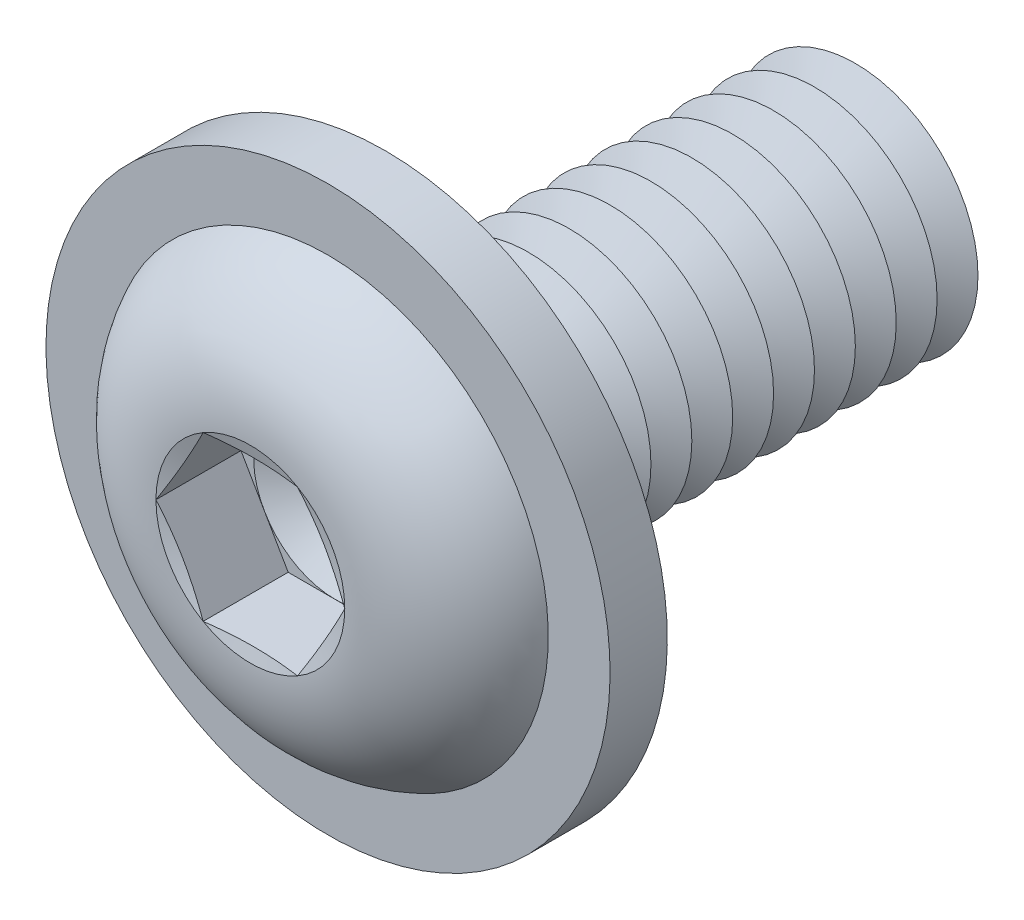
ISO-10303-21;
HEADER;
FILE_DESCRIPTION(('STEP AP214'),'2;1');
FILE_NAME('part.step','',(''),(''),'','','');
FILE_SCHEMA(('AUTOMOTIVE_DESIGN { 1 0 10303 214 1 1 1 1 }'));
ENDSEC;
DATA;
#1=APPLICATION_CONTEXT('core data for automotive mechanical design processes');
#2=APPLICATION_PROTOCOL_DEFINITION('international standard','automotive_design',2000,#1);
#3=PRODUCT_CONTEXT('',#1,'mechanical');
#4=PRODUCT('Part','Part','',(#3));
#5=PRODUCT_RELATED_PRODUCT_CATEGORY('part','',(#4));
#6=PRODUCT_DEFINITION_FORMATION('','',#4);
#7=PRODUCT_DEFINITION_CONTEXT('part definition',#1,'design');
#8=PRODUCT_DEFINITION('design','',#6,#7);
#9=PRODUCT_DEFINITION_SHAPE('','',#8);
#10=(LENGTH_UNIT() NAMED_UNIT(*) SI_UNIT(.MILLI.,.METRE.));
#11=(NAMED_UNIT(*) PLANE_ANGLE_UNIT() SI_UNIT($,.RADIAN.));
#12=(NAMED_UNIT(*) SI_UNIT($,.STERADIAN.) SOLID_ANGLE_UNIT());
#13=UNCERTAINTY_MEASURE_WITH_UNIT(LENGTH_MEASURE(1.E-05),#10,'distance_accuracy_value','');
#14=(GEOMETRIC_REPRESENTATION_CONTEXT(3) GLOBAL_UNCERTAINTY_ASSIGNED_CONTEXT((#13)) GLOBAL_UNIT_ASSIGNED_CONTEXT((#10,
#11,#12)) REPRESENTATION_CONTEXT('',''));
#15=CARTESIAN_POINT('',(0.,0.,0.));
#16=DIRECTION('',(0.,0.,1.));
#17=DIRECTION('',(1.,0.,0.));
#18=AXIS2_PLACEMENT_3D('',#15,#16,#17);
#19=CARTESIAN_POINT('',(0.,0.,-4.25));
#20=DIRECTION('',(0.,0.,1.));
#21=DIRECTION('',(1.,0.,0.));
#22=AXIS2_PLACEMENT_3D('',#19,#20,#21);
#23=CONICAL_SURFACE('',#22,1.5,1.0471975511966);
#24=CARTESIAN_POINT('',(0.,0.,-4.5));
#25=DIRECTION('',(0.,0.,1.));
#26=DIRECTION('',(1.,0.,0.));
#27=AXIS2_PLACEMENT_3D('',#24,#25,#26);
#28=CIRCLE('',#27,1.06698729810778);
#29=CARTESIAN_POINT('',(1.06698729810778,0.,-4.5));
#30=VERTEX_POINT('',#29);
#31=EDGE_CURVE('E306',#30,#30,#28,.T.);
#32=ORIENTED_EDGE('',*,*,#31,.T.);
#33=EDGE_LOOP('',(#32));
#34=FACE_BOUND('',#33,.T.);
#35=CARTESIAN_POINT('',(0.,0.,-4.25));
#36=DIRECTION('',(0.,0.,1.));
#37=DIRECTION('',(1.,0.,0.));
#38=AXIS2_PLACEMENT_3D('',#35,#36,#37);
#39=CIRCLE('',#38,1.5);
#40=CARTESIAN_POINT('',(1.5,0.,-4.25));
#41=VERTEX_POINT('',#40);
#42=EDGE_CURVE('E302',#41,#41,#39,.T.);
#43=ORIENTED_EDGE('',*,*,#42,.F.);
#44=EDGE_LOOP('',(#43));
#45=FACE_BOUND('',#44,.T.);
#46=ADVANCED_FACE('F39',(#34,#45),#23,.T.);
#47=CARTESIAN_POINT('',(0.,0.,-4.5));
#48=DIRECTION('',(0.,0.,-1.));
#49=DIRECTION('',(-1.,0.,0.));
#50=AXIS2_PLACEMENT_3D('',#47,#48,#49);
#51=CONICAL_SURFACE('',#50,1.06698729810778,1.0471975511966);
#52=CARTESIAN_POINT('',(0.,0.,-4.75));
#53=DIRECTION('',(0.,0.,1.));
#54=DIRECTION('',(1.,0.,0.));
#55=AXIS2_PLACEMENT_3D('',#52,#53,#54);
#56=CIRCLE('',#55,1.5);
#57=CARTESIAN_POINT('',(1.5,0.,-4.75));
#58=VERTEX_POINT('',#57);
#59=EDGE_CURVE('E310',#58,#58,#56,.T.);
#60=ORIENTED_EDGE('',*,*,#59,.T.);
#61=EDGE_LOOP('',(#60));
#62=FACE_BOUND('',#61,.T.);
#63=ORIENTED_EDGE('',*,*,#31,.F.);
#64=EDGE_LOOP('',(#63));
#65=FACE_BOUND('',#64,.T.);
#66=ADVANCED_FACE('F439',(#62,#65),#51,.T.);
#67=CARTESIAN_POINT('',(0.,1.5,-6.));
#68=DIRECTION('',(0.,0.,-1.));
#69=DIRECTION('',(-1.,0.,0.));
#70=AXIS2_PLACEMENT_3D('',#67,#68,#69);
#71=PLANE('',#70);
#72=CARTESIAN_POINT('',(0.,0.,-6.));
#73=DIRECTION('',(0.,0.,1.));
#74=DIRECTION('',(1.,0.,0.));
#75=AXIS2_PLACEMENT_3D('',#72,#73,#74);
#76=CIRCLE('',#75,1.06698729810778);
#77=CARTESIAN_POINT('',(1.06698729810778,0.,-6.));
#78=VERTEX_POINT('',#77);
#79=EDGE_CURVE('E330',#78,#78,#76,.T.);
#80=ORIENTED_EDGE('',*,*,#79,.F.);
#81=EDGE_LOOP('',(#80));
#82=FACE_BOUND('',#81,.T.);
#83=ADVANCED_FACE('F445',(#82),#71,.T.);
#84=CARTESIAN_POINT('',(0.,0.,-5.75));
#85=DIRECTION('',(0.,0.,1.));
#86=DIRECTION('',(1.,0.,0.));
#87=AXIS2_PLACEMENT_3D('',#84,#85,#86);
#88=CONICAL_SURFACE('',#87,1.5,1.0471975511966);
#89=ORIENTED_EDGE('',*,*,#79,.T.);
#90=EDGE_LOOP('',(#89));
#91=FACE_BOUND('',#90,.T.);
#92=CARTESIAN_POINT('',(0.,0.,-5.75));
#93=DIRECTION('',(0.,0.,1.));
#94=DIRECTION('',(1.,0.,0.));
#95=AXIS2_PLACEMENT_3D('',#92,#93,#94);
#96=CIRCLE('',#95,1.5);
#97=CARTESIAN_POINT('',(1.5,0.,-5.75));
#98=VERTEX_POINT('',#97);
#99=EDGE_CURVE('E326',#98,#98,#96,.T.);
#100=ORIENTED_EDGE('',*,*,#99,.F.);
#101=EDGE_LOOP('',(#100));
#102=FACE_BOUND('',#101,.T.);
#103=ADVANCED_FACE('F464',(#91,#102),#88,.T.);
#104=CARTESIAN_POINT('',(0.,0.,-5.5));
#105=DIRECTION('',(0.,0.,-1.));
#106=DIRECTION('',(-1.,0.,0.));
#107=AXIS2_PLACEMENT_3D('',#104,#105,#106);
#108=CONICAL_SURFACE('',#107,1.06698729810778,1.0471975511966);
#109=ORIENTED_EDGE('',*,*,#99,.T.);
#110=EDGE_LOOP('',(#109));
#111=FACE_BOUND('',#110,.T.);
#112=CARTESIAN_POINT('',(0.,0.,-5.5));
#113=DIRECTION('',(0.,0.,1.));
#114=DIRECTION('',(1.,0.,0.));
#115=AXIS2_PLACEMENT_3D('',#112,#113,#114);
#116=CIRCLE('',#115,1.06698729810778);
#117=CARTESIAN_POINT('',(1.06698729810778,0.,-5.5));
#118=VERTEX_POINT('',#117);
#119=EDGE_CURVE('E322',#118,#118,#116,.T.);
#120=ORIENTED_EDGE('',*,*,#119,.F.);
#121=EDGE_LOOP('',(#120));
#122=FACE_BOUND('',#121,.T.);
#123=ADVANCED_FACE('F461',(#111,#122),#108,.T.);
#124=CARTESIAN_POINT('',(0.,0.,-5.25));
#125=DIRECTION('',(0.,0.,1.));
#126=DIRECTION('',(1.,0.,0.));
#127=AXIS2_PLACEMENT_3D('',#124,#125,#126);
#128=CONICAL_SURFACE('',#127,1.5,1.0471975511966);
#129=ORIENTED_EDGE('',*,*,#119,.T.);
#130=EDGE_LOOP('',(#129));
#131=FACE_BOUND('',#130,.T.);
#132=CARTESIAN_POINT('',(0.,0.,-5.25));
#133=DIRECTION('',(0.,0.,1.));
#134=DIRECTION('',(1.,0.,0.));
#135=AXIS2_PLACEMENT_3D('',#132,#133,#134);
#136=CIRCLE('',#135,1.5);
#137=CARTESIAN_POINT('',(1.5,0.,-5.25));
#138=VERTEX_POINT('',#137);
#139=EDGE_CURVE('E318',#138,#138,#136,.T.);
#140=ORIENTED_EDGE('',*,*,#139,.F.);
#141=EDGE_LOOP('',(#140));
#142=FACE_BOUND('',#141,.T.);
#143=ADVANCED_FACE('F455',(#131,#142),#128,.T.);
#144=CARTESIAN_POINT('',(0.,0.,-5.));
#145=DIRECTION('',(0.,0.,-1.));
#146=DIRECTION('',(-1.,0.,0.));
#147=AXIS2_PLACEMENT_3D('',#144,#145,#146);
#148=CONICAL_SURFACE('',#147,1.06698729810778,1.0471975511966);
#149=ORIENTED_EDGE('',*,*,#139,.T.);
#150=EDGE_LOOP('',(#149));
#151=FACE_BOUND('',#150,.T.);
#152=CARTESIAN_POINT('',(0.,0.,-5.));
#153=DIRECTION('',(0.,0.,1.));
#154=DIRECTION('',(1.,0.,0.));
#155=AXIS2_PLACEMENT_3D('',#152,#153,#154);
#156=CIRCLE('',#155,1.06698729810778);
#157=CARTESIAN_POINT('',(1.06698729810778,0.,-5.));
#158=VERTEX_POINT('',#157);
#159=EDGE_CURVE('E314',#158,#158,#156,.T.);
#160=ORIENTED_EDGE('',*,*,#159,.F.);
#161=EDGE_LOOP('',(#160));
#162=FACE_BOUND('',#161,.T.);
#163=ADVANCED_FACE('F451',(#151,#162),#148,.T.);
#164=CARTESIAN_POINT('',(0.,0.,-4.75));
#165=DIRECTION('',(0.,0.,1.));
#166=DIRECTION('',(1.,0.,0.));
#167=AXIS2_PLACEMENT_3D('',#164,#165,#166);
#168=CONICAL_SURFACE('',#167,1.5,1.0471975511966);
#169=ORIENTED_EDGE('',*,*,#159,.T.);
#170=EDGE_LOOP('',(#169));
#171=FACE_BOUND('',#170,.T.);
#172=ORIENTED_EDGE('',*,*,#59,.F.);
#173=EDGE_LOOP('',(#172));
#174=FACE_BOUND('',#173,.T.);
#175=ADVANCED_FACE('F454',(#171,#174),#168,.T.);
#176=CARTESIAN_POINT('',(0.,0.,-3.75));
#177=DIRECTION('',(0.,0.,1.));
#178=DIRECTION('',(1.,0.,0.));
#179=AXIS2_PLACEMENT_3D('',#176,#177,#178);
#180=CONICAL_SURFACE('',#179,1.5,1.0471975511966);
#181=CARTESIAN_POINT('',(0.,0.,-4.));
#182=DIRECTION('',(0.,0.,1.));
#183=DIRECTION('',(1.,0.,0.));
#184=AXIS2_PLACEMENT_3D('',#181,#182,#183);
#185=CIRCLE('',#184,1.06698729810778);
#186=CARTESIAN_POINT('',(1.06698729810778,0.,-4.));
#187=VERTEX_POINT('',#186);
#188=EDGE_CURVE('E298',#187,#187,#185,.T.);
#189=ORIENTED_EDGE('',*,*,#188,.T.);
#190=EDGE_LOOP('',(#189));
#191=FACE_BOUND('',#190,.T.);
#192=CARTESIAN_POINT('',(0.,0.,-3.75));
#193=DIRECTION('',(0.,0.,1.));
#194=DIRECTION('',(1.,0.,0.));
#195=AXIS2_PLACEMENT_3D('',#192,#193,#194);
#196=CIRCLE('',#195,1.5);
#197=CARTESIAN_POINT('',(1.5,0.,-3.75));
#198=VERTEX_POINT('',#197);
#199=EDGE_CURVE('E294',#198,#198,#196,.T.);
#200=ORIENTED_EDGE('',*,*,#199,.F.);
#201=EDGE_LOOP('',(#200));
#202=FACE_BOUND('',#201,.T.);
#203=ADVANCED_FACE('F459',(#191,#202),#180,.T.);
#204=CARTESIAN_POINT('',(0.,0.,-4.));
#205=DIRECTION('',(0.,0.,-1.));
#206=DIRECTION('',(-1.,0.,0.));
#207=AXIS2_PLACEMENT_3D('',#204,#205,#206);
#208=CONICAL_SURFACE('',#207,1.06698729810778,1.0471975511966);
#209=ORIENTED_EDGE('',*,*,#42,.T.);
#210=EDGE_LOOP('',(#209));
#211=FACE_BOUND('',#210,.T.);
#212=ORIENTED_EDGE('',*,*,#188,.F.);
#213=EDGE_LOOP('',(#212));
#214=FACE_BOUND('',#213,.T.);
#215=ADVANCED_FACE('F510',(#211,#214),#208,.T.);
#216=CARTESIAN_POINT('',(0.,0.,-3.25));
#217=DIRECTION('',(0.,0.,1.));
#218=DIRECTION('',(1.,0.,0.));
#219=AXIS2_PLACEMENT_3D('',#216,#217,#218);
#220=CONICAL_SURFACE('',#219,1.5,1.0471975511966);
#221=CARTESIAN_POINT('',(0.,0.,-3.5));
#222=DIRECTION('',(0.,0.,1.));
#223=DIRECTION('',(1.,0.,0.));
#224=AXIS2_PLACEMENT_3D('',#221,#222,#223);
#225=CIRCLE('',#224,1.06698729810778);
#226=CARTESIAN_POINT('',(1.06698729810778,0.,-3.5));
#227=VERTEX_POINT('',#226);
#228=EDGE_CURVE('E290',#227,#227,#225,.T.);
#229=ORIENTED_EDGE('',*,*,#228,.T.);
#230=EDGE_LOOP('',(#229));
#231=FACE_BOUND('',#230,.T.);
#232=CARTESIAN_POINT('',(0.,0.,-3.25));
#233=DIRECTION('',(0.,0.,1.));
#234=DIRECTION('',(1.,0.,0.));
#235=AXIS2_PLACEMENT_3D('',#232,#233,#234);
#236=CIRCLE('',#235,1.5);
#237=CARTESIAN_POINT('',(1.5,0.,-3.25));
#238=VERTEX_POINT('',#237);
#239=EDGE_CURVE('E286',#238,#238,#236,.T.);
#240=ORIENTED_EDGE('',*,*,#239,.F.);
#241=EDGE_LOOP('',(#240));
#242=FACE_BOUND('',#241,.T.);
#243=ADVANCED_FACE('F516',(#231,#242),#220,.T.);
#244=CARTESIAN_POINT('',(0.,0.,-3.5));
#245=DIRECTION('',(0.,0.,-1.));
#246=DIRECTION('',(-1.,0.,0.));
#247=AXIS2_PLACEMENT_3D('',#244,#245,#246);
#248=CONICAL_SURFACE('',#247,1.06698729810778,1.0471975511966);
#249=ORIENTED_EDGE('',*,*,#199,.T.);
#250=EDGE_LOOP('',(#249));
#251=FACE_BOUND('',#250,.T.);
#252=ORIENTED_EDGE('',*,*,#228,.F.);
#253=EDGE_LOOP('',(#252));
#254=FACE_BOUND('',#253,.T.);
#255=ADVANCED_FACE('F523',(#251,#254),#248,.T.);
#256=CARTESIAN_POINT('',(0.,0.,-2.75));
#257=DIRECTION('',(0.,0.,1.));
#258=DIRECTION('',(1.,0.,0.));
#259=AXIS2_PLACEMENT_3D('',#256,#257,#258);
#260=CONICAL_SURFACE('',#259,1.5,1.0471975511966);
#261=CARTESIAN_POINT('',(0.,0.,-3.));
#262=DIRECTION('',(0.,0.,1.));
#263=DIRECTION('',(1.,0.,0.));
#264=AXIS2_PLACEMENT_3D('',#261,#262,#263);
#265=CIRCLE('',#264,1.06698729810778);
#266=CARTESIAN_POINT('',(1.06698729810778,0.,-3.));
#267=VERTEX_POINT('',#266);
#268=EDGE_CURVE('E282',#267,#267,#265,.T.);
#269=ORIENTED_EDGE('',*,*,#268,.T.);
#270=EDGE_LOOP('',(#269));
#271=FACE_BOUND('',#270,.T.);
#272=CARTESIAN_POINT('',(0.,0.,-2.75));
#273=DIRECTION('',(0.,0.,1.));
#274=DIRECTION('',(1.,0.,0.));
#275=AXIS2_PLACEMENT_3D('',#272,#273,#274);
#276=CIRCLE('',#275,1.5);
#277=CARTESIAN_POINT('',(1.5,0.,-2.75));
#278=VERTEX_POINT('',#277);
#279=EDGE_CURVE('E278',#278,#278,#276,.T.);
#280=ORIENTED_EDGE('',*,*,#279,.F.);
#281=EDGE_LOOP('',(#280));
#282=FACE_BOUND('',#281,.T.);
#283=ADVANCED_FACE('F530',(#271,#282),#260,.T.);
#284=CARTESIAN_POINT('',(0.,0.,-3.));
#285=DIRECTION('',(0.,0.,-1.));
#286=DIRECTION('',(-1.,0.,0.));
#287=AXIS2_PLACEMENT_3D('',#284,#285,#286);
#288=CONICAL_SURFACE('',#287,1.06698729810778,1.0471975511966);
#289=ORIENTED_EDGE('',*,*,#239,.T.);
#290=EDGE_LOOP('',(#289));
#291=FACE_BOUND('',#290,.T.);
#292=ORIENTED_EDGE('',*,*,#268,.F.);
#293=EDGE_LOOP('',(#292));
#294=FACE_BOUND('',#293,.T.);
#295=ADVANCED_FACE('F537',(#291,#294),#288,.T.);
#296=CARTESIAN_POINT('',(0.,0.,-2.25));
#297=DIRECTION('',(0.,0.,1.));
#298=DIRECTION('',(1.,0.,0.));
#299=AXIS2_PLACEMENT_3D('',#296,#297,#298);
#300=CONICAL_SURFACE('',#299,1.5,1.0471975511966);
#301=CARTESIAN_POINT('',(0.,0.,-2.5));
#302=DIRECTION('',(0.,0.,1.));
#303=DIRECTION('',(1.,0.,0.));
#304=AXIS2_PLACEMENT_3D('',#301,#302,#303);
#305=CIRCLE('',#304,1.06698729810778);
#306=CARTESIAN_POINT('',(1.06698729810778,0.,-2.5));
#307=VERTEX_POINT('',#306);
#308=EDGE_CURVE('E274',#307,#307,#305,.T.);
#309=ORIENTED_EDGE('',*,*,#308,.T.);
#310=EDGE_LOOP('',(#309));
#311=FACE_BOUND('',#310,.T.);
#312=CARTESIAN_POINT('',(0.,0.,-2.25));
#313=DIRECTION('',(0.,0.,1.));
#314=DIRECTION('',(1.,0.,0.));
#315=AXIS2_PLACEMENT_3D('',#312,#313,#314);
#316=CIRCLE('',#315,1.5);
#317=CARTESIAN_POINT('',(1.5,0.,-2.25));
#318=VERTEX_POINT('',#317);
#319=EDGE_CURVE('E271',#318,#318,#316,.T.);
#320=ORIENTED_EDGE('',*,*,#319,.F.);
#321=EDGE_LOOP('',(#320));
#322=FACE_BOUND('',#321,.T.);
#323=ADVANCED_FACE('F544',(#311,#322),#300,.T.);
#324=CARTESIAN_POINT('',(0.,0.,-2.5));
#325=DIRECTION('',(0.,0.,-1.));
#326=DIRECTION('',(-1.,0.,0.));
#327=AXIS2_PLACEMENT_3D('',#324,#325,#326);
#328=CONICAL_SURFACE('',#327,1.06698729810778,1.0471975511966);
#329=ORIENTED_EDGE('',*,*,#279,.T.);
#330=EDGE_LOOP('',(#329));
#331=FACE_BOUND('',#330,.T.);
#332=ORIENTED_EDGE('',*,*,#308,.F.);
#333=EDGE_LOOP('',(#332));
#334=FACE_BOUND('',#333,.T.);
#335=ADVANCED_FACE('F551',(#331,#334),#328,.T.);
#336=CARTESIAN_POINT('',(0.,0.,-1.75));
#337=DIRECTION('',(0.,0.,1.));
#338=DIRECTION('',(1.,0.,0.));
#339=AXIS2_PLACEMENT_3D('',#336,#337,#338);
#340=CONICAL_SURFACE('',#339,1.5,1.0471975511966);
#341=CARTESIAN_POINT('',(0.,0.,-2.));
#342=DIRECTION('',(0.,0.,1.));
#343=DIRECTION('',(1.,0.,0.));
#344=AXIS2_PLACEMENT_3D('',#341,#342,#343);
#345=CIRCLE('',#344,1.06698729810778);
#346=CARTESIAN_POINT('',(1.06698729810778,0.,-2.));
#347=VERTEX_POINT('',#346);
#348=EDGE_CURVE('E267',#347,#347,#345,.T.);
#349=ORIENTED_EDGE('',*,*,#348,.T.);
#350=EDGE_LOOP('',(#349));
#351=FACE_BOUND('',#350,.T.);
#352=CARTESIAN_POINT('',(0.,0.,-1.75));
#353=DIRECTION('',(0.,0.,1.));
#354=DIRECTION('',(1.,0.,0.));
#355=AXIS2_PLACEMENT_3D('',#352,#353,#354);
#356=CIRCLE('',#355,1.5);
#357=CARTESIAN_POINT('',(1.5,0.,-1.75));
#358=VERTEX_POINT('',#357);
#359=EDGE_CURVE('E263',#358,#358,#356,.T.);
#360=ORIENTED_EDGE('',*,*,#359,.F.);
#361=EDGE_LOOP('',(#360));
#362=FACE_BOUND('',#361,.T.);
#363=ADVANCED_FACE('F558',(#351,#362),#340,.T.);
#364=CARTESIAN_POINT('',(0.,0.,-2.));
#365=DIRECTION('',(0.,0.,-1.));
#366=DIRECTION('',(-1.,0.,0.));
#367=AXIS2_PLACEMENT_3D('',#364,#365,#366);
#368=CONICAL_SURFACE('',#367,1.06698729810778,1.0471975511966);
#369=ORIENTED_EDGE('',*,*,#319,.T.);
#370=EDGE_LOOP('',(#369));
#371=FACE_BOUND('',#370,.T.);
#372=ORIENTED_EDGE('',*,*,#348,.F.);
#373=EDGE_LOOP('',(#372));
#374=FACE_BOUND('',#373,.T.);
#375=ADVANCED_FACE('F565',(#371,#374),#368,.T.);
#376=CARTESIAN_POINT('',(0.,0.,-1.25));
#377=DIRECTION('',(0.,0.,1.));
#378=DIRECTION('',(1.,0.,0.));
#379=AXIS2_PLACEMENT_3D('',#376,#377,#378);
#380=CONICAL_SURFACE('',#379,1.5,1.0471975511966);
#381=CARTESIAN_POINT('',(0.,0.,-1.5));
#382=DIRECTION('',(0.,0.,1.));
#383=DIRECTION('',(1.,0.,0.));
#384=AXIS2_PLACEMENT_3D('',#381,#382,#383);
#385=CIRCLE('',#384,1.06698729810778);
#386=CARTESIAN_POINT('',(1.06698729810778,0.,-1.5));
#387=VERTEX_POINT('',#386);
#388=EDGE_CURVE('E259',#387,#387,#385,.T.);
#389=ORIENTED_EDGE('',*,*,#388,.T.);
#390=EDGE_LOOP('',(#389));
#391=FACE_BOUND('',#390,.T.);
#392=CARTESIAN_POINT('',(0.,0.,-1.25));
#393=DIRECTION('',(0.,0.,1.));
#394=DIRECTION('',(1.,0.,0.));
#395=AXIS2_PLACEMENT_3D('',#392,#393,#394);
#396=CIRCLE('',#395,1.5);
#397=CARTESIAN_POINT('',(1.5,0.,-1.25));
#398=VERTEX_POINT('',#397);
#399=EDGE_CURVE('E255',#398,#398,#396,.T.);
#400=ORIENTED_EDGE('',*,*,#399,.F.);
#401=EDGE_LOOP('',(#400));
#402=FACE_BOUND('',#401,.T.);
#403=ADVANCED_FACE('F572',(#391,#402),#380,.T.);
#404=CARTESIAN_POINT('',(0.,0.,-1.5));
#405=DIRECTION('',(0.,0.,-1.));
#406=DIRECTION('',(-1.,0.,0.));
#407=AXIS2_PLACEMENT_3D('',#404,#405,#406);
#408=CONICAL_SURFACE('',#407,1.06698729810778,1.0471975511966);
#409=ORIENTED_EDGE('',*,*,#359,.T.);
#410=EDGE_LOOP('',(#409));
#411=FACE_BOUND('',#410,.T.);
#412=ORIENTED_EDGE('',*,*,#388,.F.);
#413=EDGE_LOOP('',(#412));
#414=FACE_BOUND('',#413,.T.);
#415=ADVANCED_FACE('F579',(#411,#414),#408,.T.);
#416=CARTESIAN_POINT('',(0.,0.,-0.75));
#417=DIRECTION('',(0.,0.,1.));
#418=DIRECTION('',(1.,0.,0.));
#419=AXIS2_PLACEMENT_3D('',#416,#417,#418);
#420=CONICAL_SURFACE('',#419,1.5,1.0471975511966);
#421=CARTESIAN_POINT('',(0.,0.,-1.));
#422=DIRECTION('',(0.,0.,1.));
#423=DIRECTION('',(1.,0.,0.));
#424=AXIS2_PLACEMENT_3D('',#421,#422,#423);
#425=CIRCLE('',#424,1.06698729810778);
#426=CARTESIAN_POINT('',(1.06698729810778,0.,-1.));
#427=VERTEX_POINT('',#426);
#428=EDGE_CURVE('E251',#427,#427,#425,.T.);
#429=ORIENTED_EDGE('',*,*,#428,.T.);
#430=EDGE_LOOP('',(#429));
#431=FACE_BOUND('',#430,.T.);
#432=CARTESIAN_POINT('',(0.,0.,-0.750000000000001));
#433=DIRECTION('',(0.,0.,1.));
#434=DIRECTION('',(1.,0.,0.));
#435=AXIS2_PLACEMENT_3D('',#432,#433,#434);
#436=CIRCLE('',#435,1.5);
#437=CARTESIAN_POINT('',(1.5,0.,-0.750000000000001));
#438=VERTEX_POINT('',#437);
#439=EDGE_CURVE('E243',#438,#438,#436,.T.);
#440=ORIENTED_EDGE('',*,*,#439,.F.);
#441=EDGE_LOOP('',(#440));
#442=FACE_BOUND('',#441,.T.);
#443=ADVANCED_FACE('F586',(#431,#442),#420,.T.);
#444=CARTESIAN_POINT('',(0.,0.,-1.));
#445=DIRECTION('',(0.,0.,-1.));
#446=DIRECTION('',(-1.,0.,0.));
#447=AXIS2_PLACEMENT_3D('',#444,#445,#446);
#448=CONICAL_SURFACE('',#447,1.06698729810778,1.0471975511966);
#449=ORIENTED_EDGE('',*,*,#399,.T.);
#450=EDGE_LOOP('',(#449));
#451=FACE_BOUND('',#450,.T.);
#452=ORIENTED_EDGE('',*,*,#428,.F.);
#453=EDGE_LOOP('',(#452));
#454=FACE_BOUND('',#453,.T.);
#455=ADVANCED_FACE('F593',(#451,#454),#448,.T.);
#456=CARTESIAN_POINT('',(0.,0.,-0.25));
#457=DIRECTION('',(0.,0.,1.));
#458=DIRECTION('',(1.,0.,0.));
#459=AXIS2_PLACEMENT_3D('',#456,#457,#458);
#460=CONICAL_SURFACE('',#459,1.5,1.0471975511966);
#461=CARTESIAN_POINT('',(0.,0.,-0.5));
#462=DIRECTION('',(0.,0.,1.));
#463=DIRECTION('',(1.,0.,0.));
#464=AXIS2_PLACEMENT_3D('',#461,#462,#463);
#465=CIRCLE('',#464,1.06698729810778);
#466=CARTESIAN_POINT('',(1.06698729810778,0.,-0.5));
#467=VERTEX_POINT('',#466);
#468=EDGE_CURVE('E232',#467,#467,#465,.T.);
#469=ORIENTED_EDGE('',*,*,#468,.T.);
#470=EDGE_LOOP('',(#469));
#471=FACE_BOUND('',#470,.T.);
#472=CARTESIAN_POINT('',(0.,0.,-0.25));
#473=DIRECTION('',(0.,0.,1.));
#474=DIRECTION('',(1.,0.,0.));
#475=AXIS2_PLACEMENT_3D('',#472,#473,#474);
#476=CIRCLE('',#475,1.5);
#477=CARTESIAN_POINT('',(1.5,0.,-0.25));
#478=VERTEX_POINT('',#477);
#479=EDGE_CURVE('E247',#478,#478,#476,.T.);
#480=ORIENTED_EDGE('',*,*,#479,.F.);
#481=EDGE_LOOP('',(#480));
#482=FACE_BOUND('',#481,.T.);
#483=ADVANCED_FACE('F600',(#471,#482),#460,.T.);
#484=CARTESIAN_POINT('',(0.,0.,-0.5));
#485=DIRECTION('',(0.,0.,-1.));
#486=DIRECTION('',(-1.,0.,0.));
#487=AXIS2_PLACEMENT_3D('',#484,#485,#486);
#488=CONICAL_SURFACE('',#487,1.06698729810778,1.0471975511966);
#489=ORIENTED_EDGE('',*,*,#439,.T.);
#490=EDGE_LOOP('',(#489));
#491=FACE_BOUND('',#490,.T.);
#492=ORIENTED_EDGE('',*,*,#468,.F.);
#493=EDGE_LOOP('',(#492));
#494=FACE_BOUND('',#493,.T.);
#495=ADVANCED_FACE('F221',(#491,#494),#488,.T.);
#496=CARTESIAN_POINT('',(0.,1.5,0.));
#497=DIRECTION('',(0.,0.,-1.));
#498=DIRECTION('',(-1.,0.,0.));
#499=AXIS2_PLACEMENT_3D('',#496,#497,#498);
#500=PLANE('',#499);
#501=CARTESIAN_POINT('',(0.,0.,0.));
#502=DIRECTION('',(0.,0.,-1.));
#503=DIRECTION('',(-1.,0.,0.));
#504=AXIS2_PLACEMENT_3D('',#501,#502,#503);
#505=CIRCLE('',#504,1.75);
#506=CARTESIAN_POINT('',(-1.75,0.,0.));
#507=VERTEX_POINT('',#506);
#508=EDGE_CURVE('E339',#507,#507,#505,.F.);
#509=ORIENTED_EDGE('',*,*,#508,.T.);
#510=EDGE_LOOP('',(#509));
#511=FACE_BOUND('',#510,.T.);
#512=CARTESIAN_POINT('',(0.,0.,0.));
#513=DIRECTION('',(0.,0.,-1.));
#514=DIRECTION('',(0.,1.,0.));
#515=AXIS2_PLACEMENT_3D('',#512,#513,#514);
#516=CIRCLE('',#515,3.45);
#517=CARTESIAN_POINT('',(0.,3.45,0.));
#518=VERTEX_POINT('',#517);
#519=EDGE_CURVE('E916',#518,#518,#516,.T.);
#520=ORIENTED_EDGE('',*,*,#519,.T.);
#521=EDGE_LOOP('',(#520));
#522=FACE_BOUND('',#521,.T.);
#523=ADVANCED_FACE('F612',(#511,#522),#500,.T.);
#524=CARTESIAN_POINT('',(0.,0.,-0.25));
#525=DIRECTION('',(0.,0.,-1.));
#526=DIRECTION('',(-1.,0.,0.));
#527=AXIS2_PLACEMENT_3D('',#524,#525,#526);
#528=TOROIDAL_SURFACE('',#527,1.75,0.25);
#529=ORIENTED_EDGE('',*,*,#508,.F.);
#530=EDGE_LOOP('',(#529));
#531=FACE_BOUND('',#530,.T.);
#532=ORIENTED_EDGE('',*,*,#479,.T.);
#533=EDGE_LOOP('',(#532));
#534=FACE_BOUND('',#533,.T.);
#535=ADVANCED_FACE('F41',(#531,#534),#528,.F.);
#536=CARTESIAN_POINT('',(0.,0.,0.7));
#537=DIRECTION('',(0.,0.,-1.));
#538=DIRECTION('',(0.,1.,0.));
#539=AXIS2_PLACEMENT_3D('',#536,#537,#538);
#540=CYLINDRICAL_SURFACE('',#539,3.45);
#541=CARTESIAN_POINT('',(0.,0.,0.7));
#542=DIRECTION('',(0.,0.,-1.));
#543=DIRECTION('',(0.,1.,0.));
#544=AXIS2_PLACEMENT_3D('',#541,#542,#543);
#545=CIRCLE('',#544,3.45);
#546=CARTESIAN_POINT('',(0.,3.45,0.7));
#547=VERTEX_POINT('',#546);
#548=EDGE_CURVE('E913',#547,#547,#545,.T.);
#549=ORIENTED_EDGE('',*,*,#548,.T.);
#550=EDGE_LOOP('',(#549));
#551=FACE_BOUND('',#550,.T.);
#552=ORIENTED_EDGE('',*,*,#519,.F.);
#553=EDGE_LOOP('',(#552));
#554=FACE_BOUND('',#553,.T.);
#555=ADVANCED_FACE('F623',(#551,#554),#540,.T.);
#556=CARTESIAN_POINT('',(0.,0.,0.7));
#557=DIRECTION('',(0.,0.,-1.));
#558=DIRECTION('',(0.,1.,0.));
#559=AXIS2_PLACEMENT_3D('',#556,#557,#558);
#560=PLANE('',#559);
#561=CARTESIAN_POINT('',(0.,0.,0.7));
#562=DIRECTION('',(0.,0.,-1.));
#563=DIRECTION('',(0.,1.,0.));
#564=AXIS2_PLACEMENT_3D('',#561,#562,#563);
#565=CIRCLE('',#564,2.69421838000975);
#566=CARTESIAN_POINT('',(0.,2.69421838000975,0.7));
#567=VERTEX_POINT('',#566);
#568=EDGE_CURVE('E43',#567,#567,#565,.F.);
#569=ORIENTED_EDGE('',*,*,#568,.F.);
#570=EDGE_LOOP('',(#569));
#571=FACE_BOUND('',#570,.T.);
#572=ORIENTED_EDGE('',*,*,#548,.F.);
#573=EDGE_LOOP('',(#572));
#574=FACE_BOUND('',#573,.T.);
#575=ADVANCED_FACE('F117',(#571,#574),#560,.F.);
#576=CARTESIAN_POINT('',(0.,0.,0.609999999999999));
#577=DIRECTION('',(0.,0.,1.));
#578=DIRECTION('',(1.,0.,0.));
#579=AXIS2_PLACEMENT_3D('',#576,#577,#578);
#580=CONICAL_SURFACE('',#579,0.99999953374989,1.0471975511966);
#581=CARTESIAN_POINT('',(0.,0.,0.0326500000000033));
#582=VERTEX_POINT('',#581);
#583=VERTEX_LOOP('',#582);
#584=FACE_BOUND('',#583,.T.);
#585=CARTESIAN_POINT('',(0.,0.,0.609999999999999));
#586=DIRECTION('',(0.,0.,1.));
#587=DIRECTION('',(1.,0.,0.));
#588=AXIS2_PLACEMENT_3D('',#585,#586,#587);
#589=CIRCLE('',#588,0.99999953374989);
#590=CARTESIAN_POINT('',(0.866024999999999,0.499999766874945,0.609999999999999));
#591=VERTEX_POINT('',#590);
#592=CARTESIAN_POINT('',(0.,0.99999953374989,0.609999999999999));
#593=VERTEX_POINT('',#592);
#594=EDGE_CURVE('E120',#591,#593,#589,.T.);
#595=ORIENTED_EDGE('',*,*,#594,.T.);
#596=CARTESIAN_POINT('',(0.,0.,0.609999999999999));
#597=DIRECTION('',(0.,0.,1.));
#598=DIRECTION('',(1.,0.,0.));
#599=AXIS2_PLACEMENT_3D('',#596,#597,#598);
#600=CIRCLE('',#599,0.99999953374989);
#601=CARTESIAN_POINT('',(-0.866024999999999,0.499999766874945,0.609999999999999));
#602=VERTEX_POINT('',#601);
#603=EDGE_CURVE('E11',#593,#602,#600,.T.);
#604=ORIENTED_EDGE('',*,*,#603,.T.);
#605=CARTESIAN_POINT('',(-0.866024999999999,-0.499999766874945,0.609999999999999));
#606=VERTEX_POINT('',#605);
#607=EDGE_CURVE('E49',#602,#606,#600,.T.);
#608=ORIENTED_EDGE('',*,*,#607,.T.);
#609=CARTESIAN_POINT('',(0.,-0.99999953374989,0.609999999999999));
#610=VERTEX_POINT('',#609);
#611=EDGE_CURVE('E345',#606,#610,#600,.T.);
#612=ORIENTED_EDGE('',*,*,#611,.T.);
#613=CARTESIAN_POINT('',(0.866024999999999,-0.499999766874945,0.609999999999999));
#614=VERTEX_POINT('',#613);
#615=EDGE_CURVE('E57',#610,#614,#600,.T.);
#616=ORIENTED_EDGE('',*,*,#615,.T.);
#617=EDGE_CURVE('E50',#614,#591,#600,.T.);
#618=ORIENTED_EDGE('',*,*,#617,.T.);
#619=EDGE_LOOP('',(#595,#604,#608,#612,#616,#618));
#620=FACE_BOUND('',#619,.T.);
#621=ADVANCED_FACE('F114',(#584,#620),#580,.F.);
#622=CARTESIAN_POINT('',(0.,0.,0.609999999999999));
#623=DIRECTION('',(0.,0.,1.));
#624=DIRECTION('',(1.,0.,0.));
#625=AXIS2_PLACEMENT_3D('',#622,#623,#624);
#626=PLANE('',#625);
#627=ORIENTED_EDGE('',*,*,#611,.F.);
#628=DIRECTION('',(0.5,-0.866025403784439,0.));
#629=VECTOR('',#628,1.);
#630=CARTESIAN_POINT('',(-1.1547,0.,0.609999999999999));
#631=LINE('',#630,#629);
#632=CARTESIAN_POINT('',(-0.577349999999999,-0.99999953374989,0.609999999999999));
#633=VERTEX_POINT('',#632);
#634=EDGE_CURVE('E154',#606,#633,#631,.T.);
#635=ORIENTED_EDGE('',*,*,#634,.T.);
#636=DIRECTION('',(1.,0.,0.));
#637=VECTOR('',#636,1.);
#638=CARTESIAN_POINT('',(-0.577349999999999,-0.99999953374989,0.609999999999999));
#639=LINE('',#638,#637);
#640=EDGE_CURVE('E160',#633,#610,#639,.T.);
#641=ORIENTED_EDGE('',*,*,#640,.T.);
#642=EDGE_LOOP('',(#627,#635,#641));
#643=FACE_BOUND('',#642,.T.);
#644=ADVANCED_FACE('F116',(#643),#626,.T.);
#645=ORIENTED_EDGE('',*,*,#615,.F.);
#646=CARTESIAN_POINT('',(0.577349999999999,-0.99999953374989,0.609999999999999));
#647=VERTEX_POINT('',#646);
#648=EDGE_CURVE('E159',#610,#647,#639,.T.);
#649=ORIENTED_EDGE('',*,*,#648,.T.);
#650=DIRECTION('',(0.5,0.866025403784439,0.));
#651=VECTOR('',#650,1.);
#652=CARTESIAN_POINT('',(0.577349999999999,-0.99999953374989,0.609999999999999));
#653=LINE('',#652,#651);
#654=EDGE_CURVE('E165',#647,#614,#653,.T.);
#655=ORIENTED_EDGE('',*,*,#654,.T.);
#656=EDGE_LOOP('',(#645,#649,#655));
#657=FACE_BOUND('',#656,.T.);
#658=ADVANCED_FACE('F644',(#657),#626,.T.);
#659=ORIENTED_EDGE('',*,*,#617,.F.);
#660=CARTESIAN_POINT('',(1.1547,0.,0.609999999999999));
#661=VERTEX_POINT('',#660);
#662=EDGE_CURVE('E164',#614,#661,#653,.T.);
#663=ORIENTED_EDGE('',*,*,#662,.T.);
#664=DIRECTION('',(-0.5,0.866025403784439,0.));
#665=VECTOR('',#664,1.);
#666=CARTESIAN_POINT('',(1.1547,0.,0.609999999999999));
#667=LINE('',#666,#665);
#668=EDGE_CURVE('E142',#661,#591,#667,.T.);
#669=ORIENTED_EDGE('',*,*,#668,.T.);
#670=EDGE_LOOP('',(#659,#663,#669));
#671=FACE_BOUND('',#670,.T.);
#672=ADVANCED_FACE('F403',(#671),#626,.T.);
#673=ORIENTED_EDGE('',*,*,#594,.F.);
#674=CARTESIAN_POINT('',(0.577349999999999,0.99999953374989,0.609999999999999));
#675=VERTEX_POINT('',#674);
#676=EDGE_CURVE('E127',#591,#675,#667,.T.);
#677=ORIENTED_EDGE('',*,*,#676,.T.);
#678=DIRECTION('',(-1.,0.,0.));
#679=VECTOR('',#678,1.);
#680=CARTESIAN_POINT('',(0.577349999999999,0.99999953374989,0.609999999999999));
#681=LINE('',#680,#679);
#682=EDGE_CURVE('E138',#675,#593,#681,.T.);
#683=ORIENTED_EDGE('',*,*,#682,.T.);
#684=EDGE_LOOP('',(#673,#677,#683));
#685=FACE_BOUND('',#684,.T.);
#686=ADVANCED_FACE('F144',(#685),#626,.T.);
#687=ORIENTED_EDGE('',*,*,#603,.F.);
#688=CARTESIAN_POINT('',(-0.577350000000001,0.999999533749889,0.609999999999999));
#689=VERTEX_POINT('',#688);
#690=EDGE_CURVE('E133',#593,#689,#681,.T.);
#691=ORIENTED_EDGE('',*,*,#690,.T.);
#692=DIRECTION('',(-0.5,-0.866025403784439,0.));
#693=VECTOR('',#692,1.);
#694=CARTESIAN_POINT('',(-0.577350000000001,0.999999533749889,0.609999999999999));
#695=LINE('',#694,#693);
#696=EDGE_CURVE('E136',#689,#602,#695,.T.);
#697=ORIENTED_EDGE('',*,*,#696,.T.);
#698=EDGE_LOOP('',(#687,#691,#697));
#699=FACE_BOUND('',#698,.T.);
#700=ADVANCED_FACE('F132',(#699),#626,.T.);
#701=ORIENTED_EDGE('',*,*,#607,.F.);
#702=CARTESIAN_POINT('',(-1.1547,0.,0.609999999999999));
#703=VERTEX_POINT('',#702);
#704=EDGE_CURVE('E146',#602,#703,#695,.T.);
#705=ORIENTED_EDGE('',*,*,#704,.T.);
#706=EDGE_CURVE('E155',#703,#606,#631,.T.);
#707=ORIENTED_EDGE('',*,*,#706,.T.);
#708=EDGE_LOOP('',(#701,#705,#707));
#709=FACE_BOUND('',#708,.T.);
#710=ADVANCED_FACE('F361',(#709),#626,.T.);
#711=CARTESIAN_POINT('',(-1.1547,0.,0.609999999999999));
#712=DIRECTION('',(-0.866025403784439,-0.5,0.));
#713=DIRECTION('',(0.5,-0.866025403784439,0.));
#714=AXIS2_PLACEMENT_3D('',#711,#712,#713);
#715=PLANE('',#714);
#716=CARTESIAN_POINT('',(-1.15481547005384,0.000200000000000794,1.65003094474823));
#717=CARTESIAN_POINT('',(-1.13083002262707,-0.0413440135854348,1.64359970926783));
#718=CARTESIAN_POINT('',(-1.10680107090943,-0.0829633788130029,1.63776108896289));
#719=CARTESIAN_POINT('',(-1.05865826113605,-0.166349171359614,1.62750303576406));
#720=CARTESIAN_POINT('',(-1.03454437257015,-0.208115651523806,1.62308418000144));
#721=CARTESIAN_POINT('',(-0.986377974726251,-0.291542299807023,1.61592375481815));
#722=CARTESIAN_POINT('',(-0.962325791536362,-0.333201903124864,1.61317364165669));
#723=CARTESIAN_POINT('',(-0.914190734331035,-0.416574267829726,1.60948600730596));
#724=CARTESIAN_POINT('',(-0.890107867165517,-0.458287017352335,1.60854813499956));
#725=CARTESIAN_POINT('',(-0.841942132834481,-0.541712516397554,1.60854813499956));
#726=CARTESIAN_POINT('',(-0.817859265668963,-0.583425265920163,1.60948600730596));
#727=CARTESIAN_POINT('',(-0.769724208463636,-0.666797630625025,1.61317364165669));
#728=CARTESIAN_POINT('',(-0.745672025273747,-0.708457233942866,1.61592375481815));
#729=CARTESIAN_POINT('',(-0.697505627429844,-0.791883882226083,1.62308418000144));
#730=CARTESIAN_POINT('',(-0.673391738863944,-0.833650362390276,1.62750303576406));
#731=CARTESIAN_POINT('',(-0.625248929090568,-0.917036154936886,1.63776108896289));
#732=CARTESIAN_POINT('',(-0.60121997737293,-0.958655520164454,1.64359970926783));
#733=CARTESIAN_POINT('',(-0.577234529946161,-1.00019953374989,1.65003094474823));
#734=B_SPLINE_CURVE_WITH_KNOTS('',3,(#716,#717,#718,#719,#720,#721,#722,#723,#724,#725,#726,
#727,#728,#729,#730,#731,#732,#733),.UNSPECIFIED.,.F.,.F.,(4,2,2,2,2,2,2,2,4),(0.,
0.145207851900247,0.290474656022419,0.434991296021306,0.579479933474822,0.723968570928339,
0.868485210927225,1.0137520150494,1.15895986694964),.UNSPECIFIED.);
#735=CARTESIAN_POINT('',(-1.1547,0.,1.65));
#736=VERTEX_POINT('',#735);
#737=CARTESIAN_POINT('',(-0.577349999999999,-0.99999953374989,1.65));
#738=VERTEX_POINT('',#737);
#739=EDGE_CURVE('E366',#736,#738,#734,.T.);
#740=ORIENTED_EDGE('',*,*,#739,.T.);
#741=DIRECTION('',(0.,0.,1.));
#742=VECTOR('',#741,1.);
#743=CARTESIAN_POINT('',(-0.577349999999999,-0.99999953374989,0.609999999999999));
#744=LINE('',#743,#742);
#745=EDGE_CURVE('E178',#633,#738,#744,.T.);
#746=ORIENTED_EDGE('',*,*,#745,.F.);
#747=ORIENTED_EDGE('',*,*,#634,.F.);
#748=ORIENTED_EDGE('',*,*,#706,.F.);
#749=DIRECTION('',(0.,0.,1.));
#750=VECTOR('',#749,1.);
#751=CARTESIAN_POINT('',(-1.1547,0.,0.609999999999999));
#752=LINE('',#751,#750);
#753=EDGE_CURVE('E182',#703,#736,#752,.T.);
#754=ORIENTED_EDGE('',*,*,#753,.T.);
#755=EDGE_LOOP('',(#740,#746,#747,#748,#754));
#756=FACE_BOUND('',#755,.T.);
#757=ADVANCED_FACE('F359',(#756),#715,.F.);
#758=CARTESIAN_POINT('',(-0.577349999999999,-0.99999953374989,0.609999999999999));
#759=DIRECTION('',(0.,-1.,0.));
#760=DIRECTION('',(0.,0.,-1.));
#761=AXIS2_PLACEMENT_3D('',#758,#759,#760);
#762=PLANE('',#761);
#763=CARTESIAN_POINT('',(-1.7425668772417,-0.99999953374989,1.87893949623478));
#764=CARTESIAN_POINT('',(-1.65819693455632,-0.99999953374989,1.85935934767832));
#765=CARTESIAN_POINT('',(-1.57375647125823,-0.99999953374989,1.84006351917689));
#766=CARTESIAN_POINT('',(-1.40464514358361,-0.99999953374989,1.80242908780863));
#767=CARTESIAN_POINT('',(-1.31997423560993,-0.99999953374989,1.78409068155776));
#768=CARTESIAN_POINT('',(-1.14955192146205,-0.99999953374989,1.74860242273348));
#769=CARTESIAN_POINT('',(-1.06379782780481,-0.99999953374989,1.73146532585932));
#770=CARTESIAN_POINT('',(-0.891887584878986,-0.99999953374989,1.69925819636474));
#771=CARTESIAN_POINT('',(-0.805731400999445,-0.99999953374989,1.68418834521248));
#772=CARTESIAN_POINT('',(-0.635256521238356,-0.99999953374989,1.65751615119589));
#773=CARTESIAN_POINT('',(-0.550951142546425,-0.99999953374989,1.64583105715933));
#774=CARTESIAN_POINT('',(-0.381865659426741,-0.99999953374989,1.62668811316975));
#775=CARTESIAN_POINT('',(-0.297085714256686,-0.99999953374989,1.61922892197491));
#776=CARTESIAN_POINT('',(-0.127577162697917,-0.99999953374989,1.60981453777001));
#777=CARTESIAN_POINT('',(-0.0428499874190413,-0.99999953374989,1.60783514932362));
#778=CARTESIAN_POINT('',(0.126542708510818,-0.99999953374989,1.60973012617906));
#779=CARTESIAN_POINT('',(0.211208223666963,-0.99999953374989,1.61360496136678));
#780=CARTESIAN_POINT('',(0.356115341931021,-0.99999953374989,1.62460226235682));
#781=CARTESIAN_POINT('',(0.416458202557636,-0.99999953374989,1.63048841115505));
#782=CARTESIAN_POINT('',(0.536893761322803,-0.99999953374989,1.64437752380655));
#783=CARTESIAN_POINT('',(0.596986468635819,-0.99999953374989,1.65238040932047));
#784=CARTESIAN_POINT('',(0.777275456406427,-0.99999953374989,1.67888855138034));
#785=CARTESIAN_POINT('',(0.897104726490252,-0.99999953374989,1.69985858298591));
#786=CARTESIAN_POINT('',(1.07751611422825,-0.99999953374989,1.73433574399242));
#787=CARTESIAN_POINT('',(1.1383777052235,-0.99999953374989,1.74646914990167));
#788=CARTESIAN_POINT('',(1.25994955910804,-0.99999953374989,1.7714845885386));
#789=CARTESIAN_POINT('',(1.32065982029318,-0.99999953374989,1.7843666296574));
#790=CARTESIAN_POINT('',(1.44162663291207,-0.99999953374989,1.81062164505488));
#791=CARTESIAN_POINT('',(1.50188385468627,-0.99999953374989,1.82399156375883));
#792=CARTESIAN_POINT('',(1.62229550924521,-0.99999953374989,1.85116781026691));
#793=CARTESIAN_POINT('',(1.68244994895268,-0.99999953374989,1.86497410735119));
#794=CARTESIAN_POINT('',(1.7425668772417,-0.99999953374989,1.87893949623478));
#795=B_SPLINE_CURVE_WITH_KNOTS('',3,(#763,#764,#765,#766,#767,#768,#769,#770,#771,#772,#773,
#774,#775,#776,#777,#778,#779,#780,#781,#782,#783,#784,#785,#786,#787,#788,#789,#790,#791,#792,
#793,#794),.UNSPECIFIED.,.F.,.F.,(4,2,2,2,2,2,2,2,2,2,2,2,2,2,2,4),(0.,0.259842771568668,
0.519738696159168,0.782071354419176,1.04442702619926,1.29968778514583,1.55486748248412,
1.80891865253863,2.06299021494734,2.24483732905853,2.42667771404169,2.79149503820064,
2.97767344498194,3.16385393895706,3.34902052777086,3.53417411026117),.UNSPECIFIED.);
#796=CARTESIAN_POINT('',(0.577349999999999,-0.99999953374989,1.65));
#797=VERTEX_POINT('',#796);
#798=EDGE_CURVE('E373',#738,#797,#795,.T.);
#799=ORIENTED_EDGE('',*,*,#798,.T.);
#800=DIRECTION('',(0.,0.,1.));
#801=VECTOR('',#800,1.);
#802=CARTESIAN_POINT('',(0.577349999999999,-0.99999953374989,0.609999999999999));
#803=LINE('',#802,#801);
#804=EDGE_CURVE('E174',#647,#797,#803,.T.);
#805=ORIENTED_EDGE('',*,*,#804,.F.);
#806=ORIENTED_EDGE('',*,*,#648,.F.);
#807=ORIENTED_EDGE('',*,*,#640,.F.);
#808=ORIENTED_EDGE('',*,*,#745,.T.);
#809=EDGE_LOOP('',(#799,#805,#806,#807,#808));
#810=FACE_BOUND('',#809,.T.);
#811=ADVANCED_FACE('F428',(#810),#762,.F.);
#812=CARTESIAN_POINT('',(0.577349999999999,-0.99999953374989,0.609999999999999));
#813=DIRECTION('',(0.866025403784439,-0.5,0.));
#814=DIRECTION('',(0.5,0.866025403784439,0.));
#815=AXIS2_PLACEMENT_3D('',#812,#813,#814);
#816=PLANE('',#815);
#817=CARTESIAN_POINT('',(0.577234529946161,-1.00019953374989,1.65003094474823));
#818=CARTESIAN_POINT('',(0.601219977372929,-0.958655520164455,1.64359970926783));
#819=CARTESIAN_POINT('',(0.625248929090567,-0.917036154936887,1.63776108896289));
#820=CARTESIAN_POINT('',(0.673391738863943,-0.833650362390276,1.62750303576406));
#821=CARTESIAN_POINT('',(0.697505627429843,-0.791883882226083,1.62308418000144));
#822=CARTESIAN_POINT('',(0.745672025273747,-0.708457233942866,1.61592375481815));
#823=CARTESIAN_POINT('',(0.769724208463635,-0.666797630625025,1.61317364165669));
#824=CARTESIAN_POINT('',(0.817859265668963,-0.583425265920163,1.60948600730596));
#825=CARTESIAN_POINT('',(0.841942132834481,-0.541712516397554,1.60854813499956));
#826=CARTESIAN_POINT('',(0.890107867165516,-0.458287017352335,1.60854813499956));
#827=CARTESIAN_POINT('',(0.914190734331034,-0.416574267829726,1.60948600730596));
#828=CARTESIAN_POINT('',(0.962325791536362,-0.333201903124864,1.61317364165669));
#829=CARTESIAN_POINT('',(0.986377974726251,-0.291542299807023,1.61592375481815));
#830=CARTESIAN_POINT('',(1.03454437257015,-0.208115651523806,1.62308418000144));
#831=CARTESIAN_POINT('',(1.05865826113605,-0.166349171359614,1.62750303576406));
#832=CARTESIAN_POINT('',(1.10680107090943,-0.0829633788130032,1.63776108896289));
#833=CARTESIAN_POINT('',(1.13083002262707,-0.0413440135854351,1.64359970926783));
#834=CARTESIAN_POINT('',(1.15481547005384,0.0002000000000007,1.65003094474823));
#835=B_SPLINE_CURVE_WITH_KNOTS('',3,(#817,#818,#819,#820,#821,#822,#823,#824,#825,#826,#827,
#828,#829,#830,#831,#832,#833,#834),.UNSPECIFIED.,.F.,.F.,(4,2,2,2,2,2,2,2,4),(0.,
0.145207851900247,0.290474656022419,0.434991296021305,0.579479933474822,0.723968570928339,
0.868485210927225,1.0137520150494,1.15895986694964),.UNSPECIFIED.);
#836=CARTESIAN_POINT('',(1.1547,0.,1.65));
#837=VERTEX_POINT('',#836);
#838=EDGE_CURVE('E233',#797,#837,#835,.T.);
#839=ORIENTED_EDGE('',*,*,#838,.T.);
#840=DIRECTION('',(0.,0.,1.));
#841=VECTOR('',#840,1.);
#842=CARTESIAN_POINT('',(1.1547,0.,0.609999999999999));
#843=LINE('',#842,#841);
#844=EDGE_CURVE('E169',#661,#837,#843,.T.);
#845=ORIENTED_EDGE('',*,*,#844,.F.);
#846=ORIENTED_EDGE('',*,*,#662,.F.);
#847=ORIENTED_EDGE('',*,*,#654,.F.);
#848=ORIENTED_EDGE('',*,*,#804,.T.);
#849=EDGE_LOOP('',(#839,#845,#846,#847,#848));
#850=FACE_BOUND('',#849,.T.);
#851=ADVANCED_FACE('F219',(#850),#816,.F.);
#852=CARTESIAN_POINT('',(1.1547,0.,0.609999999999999));
#853=DIRECTION('',(0.866025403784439,0.5,0.));
#854=DIRECTION('',(-0.5,0.866025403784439,0.));
#855=AXIS2_PLACEMENT_3D('',#852,#853,#854);
#856=PLANE('',#855);
#857=CARTESIAN_POINT('',(1.15481547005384,-0.000199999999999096,1.65003094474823));
#858=CARTESIAN_POINT('',(1.13083002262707,0.0413440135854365,1.64359970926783));
#859=CARTESIAN_POINT('',(1.10680107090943,0.0829633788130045,1.63776108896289));
#860=CARTESIAN_POINT('',(1.05865826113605,0.166349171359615,1.62750303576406));
#861=CARTESIAN_POINT('',(1.03454437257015,0.208115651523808,1.62308418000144));
#862=CARTESIAN_POINT('',(0.986377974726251,0.291542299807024,1.61592375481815));
#863=CARTESIAN_POINT('',(0.962325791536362,0.333201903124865,1.61317364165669));
#864=CARTESIAN_POINT('',(0.914190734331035,0.416574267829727,1.60948600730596));
#865=CARTESIAN_POINT('',(0.890107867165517,0.458287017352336,1.60854813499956));
#866=CARTESIAN_POINT('',(0.841942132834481,0.541712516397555,1.60854813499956));
#867=CARTESIAN_POINT('',(0.817859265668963,0.583425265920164,1.60948600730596));
#868=CARTESIAN_POINT('',(0.769724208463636,0.666797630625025,1.61317364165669));
#869=CARTESIAN_POINT('',(0.745672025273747,0.708457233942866,1.61592375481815));
#870=CARTESIAN_POINT('',(0.697505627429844,0.791883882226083,1.62308418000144));
#871=CARTESIAN_POINT('',(0.673391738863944,0.833650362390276,1.62750303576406));
#872=CARTESIAN_POINT('',(0.625248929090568,0.917036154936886,1.63776108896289));
#873=CARTESIAN_POINT('',(0.60121997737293,0.958655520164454,1.64359970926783));
#874=CARTESIAN_POINT('',(0.577234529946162,1.00019953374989,1.65003094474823));
#875=B_SPLINE_CURVE_WITH_KNOTS('',3,(#857,#858,#859,#860,#861,#862,#863,#864,#865,#866,#867,
#868,#869,#870,#871,#872,#873,#874),.UNSPECIFIED.,.F.,.F.,(4,2,2,2,2,2,2,2,4),(0.,
0.145207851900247,0.290474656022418,0.434991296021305,0.579479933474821,0.723968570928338,
0.868485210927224,1.0137520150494,1.15895986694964),.UNSPECIFIED.);
#876=CARTESIAN_POINT('',(0.577349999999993,0.999999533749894,1.65));
#877=VERTEX_POINT('',#876);
#878=EDGE_CURVE('E224',#837,#877,#875,.T.);
#879=ORIENTED_EDGE('',*,*,#878,.T.);
#880=DIRECTION('',(0.,0.,1.));
#881=VECTOR('',#880,1.);
#882=CARTESIAN_POINT('',(0.577349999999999,0.99999953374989,0.609999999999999));
#883=LINE('',#882,#881);
#884=EDGE_CURVE('E65',#675,#877,#883,.T.);
#885=ORIENTED_EDGE('',*,*,#884,.F.);
#886=ORIENTED_EDGE('',*,*,#676,.F.);
#887=ORIENTED_EDGE('',*,*,#668,.F.);
#888=ORIENTED_EDGE('',*,*,#844,.T.);
#889=EDGE_LOOP('',(#879,#885,#886,#887,#888));
#890=FACE_BOUND('',#889,.T.);
#891=ADVANCED_FACE('F213',(#890),#856,.F.);
#892=CARTESIAN_POINT('',(0.577349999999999,0.99999953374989,0.609999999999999));
#893=DIRECTION('',(0.,1.,0.));
#894=DIRECTION('',(-1.,0.,0.));
#895=AXIS2_PLACEMENT_3D('',#892,#893,#894);
#896=PLANE('',#895);
#897=CARTESIAN_POINT('',(1.7425668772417,0.99999953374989,1.87893949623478));
#898=CARTESIAN_POINT('',(1.65819693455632,0.999999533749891,1.85935934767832));
#899=CARTESIAN_POINT('',(1.57375647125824,0.99999953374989,1.84006351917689));
#900=CARTESIAN_POINT('',(1.40464514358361,0.99999953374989,1.80242908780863));
#901=CARTESIAN_POINT('',(1.31997423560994,0.99999953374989,1.78409068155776));
#902=CARTESIAN_POINT('',(1.14955192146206,0.99999953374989,1.74860242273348));
#903=CARTESIAN_POINT('',(1.06379782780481,0.99999953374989,1.73146532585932));
#904=CARTESIAN_POINT('',(0.891887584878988,0.99999953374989,1.69925819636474));
#905=CARTESIAN_POINT('',(0.805731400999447,0.99999953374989,1.68418834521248));
#906=CARTESIAN_POINT('',(0.635256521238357,0.99999953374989,1.65751615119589));
#907=CARTESIAN_POINT('',(0.550951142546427,0.99999953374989,1.64583105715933));
#908=CARTESIAN_POINT('',(0.381865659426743,0.99999953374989,1.62668811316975));
#909=CARTESIAN_POINT('',(0.297085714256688,0.99999953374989,1.61922892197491));
#910=CARTESIAN_POINT('',(0.127577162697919,0.99999953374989,1.60981453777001));
#911=CARTESIAN_POINT('',(0.0428499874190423,0.99999953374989,1.60783514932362));
#912=CARTESIAN_POINT('',(-0.126542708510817,0.99999953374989,1.60973012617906));
#913=CARTESIAN_POINT('',(-0.211208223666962,0.999999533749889,1.61360496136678));
#914=CARTESIAN_POINT('',(-0.356115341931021,0.999999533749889,1.62460226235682));
#915=CARTESIAN_POINT('',(-0.416458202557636,0.999999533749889,1.63048841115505));
#916=CARTESIAN_POINT('',(-0.536893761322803,0.999999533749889,1.64437752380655));
#917=CARTESIAN_POINT('',(-0.596986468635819,0.999999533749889,1.65238040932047));
#918=CARTESIAN_POINT('',(-0.777275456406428,0.999999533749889,1.67888855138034));
#919=CARTESIAN_POINT('',(-0.897104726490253,0.999999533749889,1.69985858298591));
#920=CARTESIAN_POINT('',(-1.07751611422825,0.999999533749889,1.73433574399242));
#921=CARTESIAN_POINT('',(-1.1383777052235,0.999999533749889,1.74646914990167));
#922=CARTESIAN_POINT('',(-1.25994955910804,0.999999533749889,1.7714845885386));
#923=CARTESIAN_POINT('',(-1.32065982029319,0.999999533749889,1.7843666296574));
#924=CARTESIAN_POINT('',(-1.44162663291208,0.999999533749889,1.81062164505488));
#925=CARTESIAN_POINT('',(-1.50188385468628,0.999999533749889,1.82399156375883));
#926=CARTESIAN_POINT('',(-1.62229550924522,0.999999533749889,1.85116781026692));
#927=CARTESIAN_POINT('',(-1.68244994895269,0.999999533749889,1.86497410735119));
#928=CARTESIAN_POINT('',(-1.7425668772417,0.999999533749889,1.87893949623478));
#929=B_SPLINE_CURVE_WITH_KNOTS('',3,(#897,#898,#899,#900,#901,#902,#903,#904,#905,#906,#907,
#908,#909,#910,#911,#912,#913,#914,#915,#916,#917,#918,#919,#920,#921,#922,#923,#924,#925,#926,
#927,#928),.UNSPECIFIED.,.F.,.F.,(4,2,2,2,2,2,2,2,2,2,2,2,2,2,2,4),(0.,0.259842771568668,
0.519738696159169,0.782071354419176,1.04442702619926,1.29968778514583,1.55486748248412,
1.80891865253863,2.06299021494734,2.24483732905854,2.42667771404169,2.79149503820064,
2.97767344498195,3.16385393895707,3.34902052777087,3.53417411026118),.UNSPECIFIED.);
#930=CARTESIAN_POINT('',(-0.577350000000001,0.999999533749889,1.65));
#931=VERTEX_POINT('',#930);
#932=EDGE_CURVE('E173',#877,#931,#929,.T.);
#933=ORIENTED_EDGE('',*,*,#932,.T.);
#934=DIRECTION('',(0.,0.,1.));
#935=VECTOR('',#934,1.);
#936=CARTESIAN_POINT('',(-0.577350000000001,0.999999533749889,0.609999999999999));
#937=LINE('',#936,#935);
#938=EDGE_CURVE('E140',#689,#931,#937,.T.);
#939=ORIENTED_EDGE('',*,*,#938,.F.);
#940=ORIENTED_EDGE('',*,*,#690,.F.);
#941=ORIENTED_EDGE('',*,*,#682,.F.);
#942=ORIENTED_EDGE('',*,*,#884,.T.);
#943=EDGE_LOOP('',(#933,#939,#940,#941,#942));
#944=FACE_BOUND('',#943,.T.);
#945=ADVANCED_FACE('F137',(#944),#896,.F.);
#946=CARTESIAN_POINT('',(-0.577350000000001,0.999999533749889,0.609999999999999));
#947=DIRECTION('',(-0.866025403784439,0.5,0.));
#948=DIRECTION('',(-0.5,-0.866025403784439,0.));
#949=AXIS2_PLACEMENT_3D('',#946,#947,#948);
#950=PLANE('',#949);
#951=CARTESIAN_POINT('',(-0.577234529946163,1.00019953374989,1.65003094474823));
#952=CARTESIAN_POINT('',(-0.601219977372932,0.958655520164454,1.64359970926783));
#953=CARTESIAN_POINT('',(-0.625248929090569,0.917036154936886,1.63776108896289));
#954=CARTESIAN_POINT('',(-0.673391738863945,0.833650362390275,1.62750303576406));
#955=CARTESIAN_POINT('',(-0.697505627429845,0.791883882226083,1.62308418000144));
#956=CARTESIAN_POINT('',(-0.745672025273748,0.708457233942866,1.61592375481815));
#957=CARTESIAN_POINT('',(-0.769724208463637,0.666797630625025,1.61317364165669));
#958=CARTESIAN_POINT('',(-0.817859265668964,0.583425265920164,1.60948600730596));
#959=CARTESIAN_POINT('',(-0.841942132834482,0.541712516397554,1.60854813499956));
#960=CARTESIAN_POINT('',(-0.890107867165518,0.458287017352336,1.60854813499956));
#961=CARTESIAN_POINT('',(-0.914190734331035,0.416574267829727,1.60948600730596));
#962=CARTESIAN_POINT('',(-0.962325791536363,0.333201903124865,1.61317364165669));
#963=CARTESIAN_POINT('',(-0.986377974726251,0.291542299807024,1.61592375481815));
#964=CARTESIAN_POINT('',(-1.03454437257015,0.208115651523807,1.62308418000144));
#965=CARTESIAN_POINT('',(-1.05865826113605,0.166349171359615,1.62750303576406));
#966=CARTESIAN_POINT('',(-1.10680107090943,0.0829633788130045,1.63776108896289));
#967=CARTESIAN_POINT('',(-1.13083002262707,0.0413440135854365,1.64359970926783));
#968=CARTESIAN_POINT('',(-1.15481547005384,-0.00019999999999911,1.65003094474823));
#969=B_SPLINE_CURVE_WITH_KNOTS('',3,(#951,#952,#953,#954,#955,#956,#957,#958,#959,#960,#961,
#962,#963,#964,#965,#966,#967,#968),.UNSPECIFIED.,.F.,.F.,(4,2,2,2,2,2,2,2,4),(0.,
0.145207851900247,0.290474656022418,0.434991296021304,0.579479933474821,0.723968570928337,
0.868485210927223,1.01375201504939,1.15895986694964),.UNSPECIFIED.);
#970=EDGE_CURVE('E198',#931,#736,#969,.T.);
#971=ORIENTED_EDGE('',*,*,#970,.T.);
#972=ORIENTED_EDGE('',*,*,#753,.F.);
#973=ORIENTED_EDGE('',*,*,#704,.F.);
#974=ORIENTED_EDGE('',*,*,#696,.F.);
#975=ORIENTED_EDGE('',*,*,#938,.T.);
#976=EDGE_LOOP('',(#971,#972,#973,#974,#975));
#977=FACE_BOUND('',#976,.T.);
#978=ADVANCED_FACE('F212',(#977),#950,.F.);
#979=CARTESIAN_POINT('',(0.,0.,1.65));
#980=DIRECTION('',(0.,0.,1.));
#981=DIRECTION('',(1.,0.,0.));
#982=AXIS2_PLACEMENT_3D('',#979,#980,#981);
#983=CONICAL_SURFACE('',#982,1.1547,1.30899693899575);
#984=ORIENTED_EDGE('',*,*,#739,.F.);
#985=CARTESIAN_POINT('',(0.,0.,1.65));
#986=DIRECTION('',(0.,0.,-1.));
#987=DIRECTION('',(-1.,0.,0.));
#988=AXIS2_PLACEMENT_3D('',#985,#986,#987);
#989=CIRCLE('',#988,1.1547);
#990=EDGE_CURVE('E334',#738,#736,#989,.T.);
#991=ORIENTED_EDGE('',*,*,#990,.F.);
#992=EDGE_LOOP('',(#984,#991));
#993=FACE_BOUND('',#992,.T.);
#994=ADVANCED_FACE('F370',(#993),#983,.F.);
#995=ORIENTED_EDGE('',*,*,#798,.F.);
#996=EDGE_CURVE('E381',#797,#738,#989,.T.);
#997=ORIENTED_EDGE('',*,*,#996,.F.);
#998=EDGE_LOOP('',(#995,#997));
#999=FACE_BOUND('',#998,.T.);
#1000=ADVANCED_FACE('F415',(#999),#983,.F.);
#1001=ORIENTED_EDGE('',*,*,#838,.F.);
#1002=EDGE_CURVE('E394',#837,#797,#989,.T.);
#1003=ORIENTED_EDGE('',*,*,#1002,.F.);
#1004=EDGE_LOOP('',(#1001,#1003));
#1005=FACE_BOUND('',#1004,.T.);
#1006=ADVANCED_FACE('F411',(#1005),#983,.F.);
#1007=ORIENTED_EDGE('',*,*,#878,.F.);
#1008=EDGE_CURVE('E392',#877,#837,#989,.T.);
#1009=ORIENTED_EDGE('',*,*,#1008,.F.);
#1010=EDGE_LOOP('',(#1007,#1009));
#1011=FACE_BOUND('',#1010,.T.);
#1012=ADVANCED_FACE('F408',(#1011),#983,.F.);
#1013=ORIENTED_EDGE('',*,*,#932,.F.);
#1014=EDGE_CURVE('E340',#931,#877,#989,.T.);
#1015=ORIENTED_EDGE('',*,*,#1014,.F.);
#1016=EDGE_LOOP('',(#1013,#1015));
#1017=FACE_BOUND('',#1016,.T.);
#1018=ADVANCED_FACE('F205',(#1017),#983,.F.);
#1019=ORIENTED_EDGE('',*,*,#970,.F.);
#1020=EDGE_CURVE('E335',#736,#931,#989,.T.);
#1021=ORIENTED_EDGE('',*,*,#1020,.F.);
#1022=EDGE_LOOP('',(#1019,#1021));
#1023=FACE_BOUND('',#1022,.T.);
#1024=ADVANCED_FACE('F384',(#1023),#983,.F.);
#1025=CARTESIAN_POINT('',(0.,0.,0.));
#1026=DIRECTION('',(0.,0.,-1.));
#1027=DIRECTION('',(-1.,0.,0.));
#1028=AXIS2_PLACEMENT_3D('',#1025,#1026,#1027);
#1029=DEGENERATE_TOROIDAL_SURFACE('',#1028,1.19939477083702,1.65060522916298,.T.);
#1030=ORIENTED_EDGE('',*,*,#1020,.T.);
#1031=ORIENTED_EDGE('',*,*,#1014,.T.);
#1032=ORIENTED_EDGE('',*,*,#1008,.T.);
#1033=ORIENTED_EDGE('',*,*,#1002,.T.);
#1034=ORIENTED_EDGE('',*,*,#996,.T.);
#1035=ORIENTED_EDGE('',*,*,#990,.T.);
#1036=EDGE_LOOP('',(#1030,#1031,#1032,#1033,#1034,#1035));
#1037=FACE_BOUND('',#1036,.T.);
#1038=ORIENTED_EDGE('',*,*,#568,.T.);
#1039=EDGE_LOOP('',(#1038));
#1040=FACE_BOUND('',#1039,.T.);
#1041=ADVANCED_FACE('F376',(#1037,#1040),#1029,.T.);
#1042=CLOSED_SHELL('',(#46,#66,#83,#103,#123,#143,#163,#175,#203,#215,#243,#255,#283,#295,#323,
#335,#363,#375,#403,#415,#443,#455,#483,#495,#523,#535,#555,#575,#621,#644,#658,#672,#686,#700,
#710,#757,#811,#851,#891,#945,#978,#994,#1000,#1006,#1012,#1018,#1024,#1041));
#1043=MANIFOLD_SOLID_BREP('B2',#1042);
#1044=ADVANCED_BREP_SHAPE_REPRESENTATION('',(#18,#1043),#14);
#1045=SHAPE_DEFINITION_REPRESENTATION(#9,#1044);
ENDSEC;
END-ISO-10303-21;
